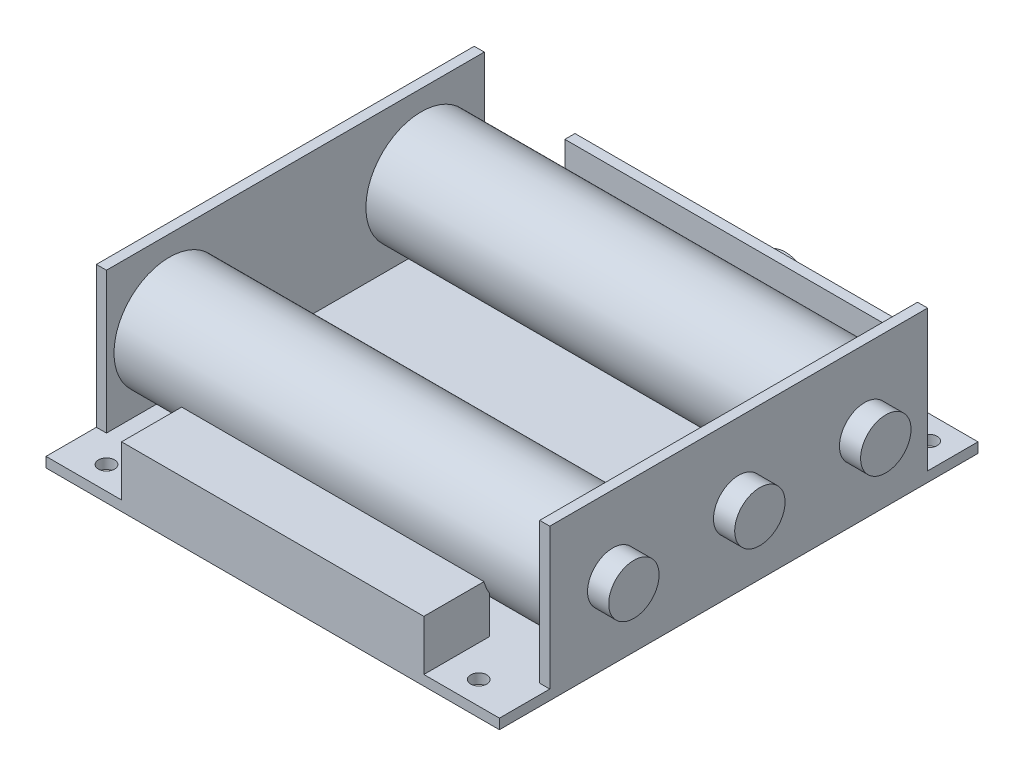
ISO-10303-21;
HEADER;
FILE_DESCRIPTION(('STEP AP214'),'2;1');
FILE_NAME('part.step','',(''),(''),'','','');
FILE_SCHEMA(('AUTOMOTIVE_DESIGN { 1 0 10303 214 1 1 1 1 }'));
ENDSEC;
DATA;
#1=APPLICATION_CONTEXT('core data for automotive mechanical design processes');
#2=APPLICATION_PROTOCOL_DEFINITION('international standard','automotive_design',2000,#1);
#3=PRODUCT_CONTEXT('',#1,'mechanical');
#4=PRODUCT('Part','Part','',(#3));
#5=PRODUCT_RELATED_PRODUCT_CATEGORY('part','',(#4));
#6=PRODUCT_DEFINITION_FORMATION('','',#4);
#7=PRODUCT_DEFINITION_CONTEXT('part definition',#1,'design');
#8=PRODUCT_DEFINITION('design','',#6,#7);
#9=PRODUCT_DEFINITION_SHAPE('','',#8);
#10=(LENGTH_UNIT() NAMED_UNIT(*) SI_UNIT(.MILLI.,.METRE.));
#11=(NAMED_UNIT(*) PLANE_ANGLE_UNIT() SI_UNIT($,.RADIAN.));
#12=(NAMED_UNIT(*) SI_UNIT($,.STERADIAN.) SOLID_ANGLE_UNIT());
#13=UNCERTAINTY_MEASURE_WITH_UNIT(LENGTH_MEASURE(1.E-05),#10,'distance_accuracy_value','');
#14=(GEOMETRIC_REPRESENTATION_CONTEXT(3) GLOBAL_UNCERTAINTY_ASSIGNED_CONTEXT((#13)) GLOBAL_UNIT_ASSIGNED_CONTEXT((#10,
#11,#12)) REPRESENTATION_CONTEXT('',''));
#15=CARTESIAN_POINT('',(0.,0.,0.));
#16=DIRECTION('',(0.,0.,1.));
#17=DIRECTION('',(1.,0.,0.));
#18=AXIS2_PLACEMENT_3D('',#15,#16,#17);
#19=CARTESIAN_POINT('',(-49.2,15.,25.));
#20=DIRECTION('',(1.,0.,0.));
#21=DIRECTION('',(0.,0.,-1.));
#22=AXIS2_PLACEMENT_3D('',#19,#20,#21);
#23=CYLINDRICAL_SURFACE('',#22,11.);
#24=CARTESIAN_POINT('',(43.,15.,25.));
#25=DIRECTION('',(1.,0.,0.));
#26=DIRECTION('',(0.,0.,-1.));
#27=AXIS2_PLACEMENT_3D('',#24,#25,#26);
#28=CIRCLE('',#27,11.);
#29=CARTESIAN_POINT('',(43.,15.,14.));
#30=VERTEX_POINT('',#29);
#31=EDGE_CURVE('E11',#30,#30,#28,.F.);
#32=ORIENTED_EDGE('',*,*,#31,.T.);
#33=EDGE_LOOP('',(#32));
#34=FACE_BOUND('',#33,.T.);
#35=CARTESIAN_POINT('',(-43.,15.,25.));
#36=DIRECTION('',(1.,0.,0.));
#37=DIRECTION('',(0.,0.,-1.));
#38=AXIS2_PLACEMENT_3D('',#35,#36,#37);
#39=CIRCLE('',#38,11.);
#40=CARTESIAN_POINT('',(-43.,15.,14.));
#41=VERTEX_POINT('',#40);
#42=EDGE_CURVE('E45',#41,#41,#39,.T.);
#43=ORIENTED_EDGE('',*,*,#42,.T.);
#44=EDGE_LOOP('',(#43));
#45=FACE_BOUND('',#44,.T.);
#46=ADVANCED_FACE('F44',(#34,#45),#23,.T.);
#47=OPEN_SHELL('',(#46));
#48=SHELL_BASED_SURFACE_MODEL('B2',(#47));
#49=CARTESIAN_POINT('',(-49.2,15.,-25.));
#50=DIRECTION('',(1.,0.,0.));
#51=DIRECTION('',(0.,0.,-1.));
#52=AXIS2_PLACEMENT_3D('',#49,#50,#51);
#53=CYLINDRICAL_SURFACE('',#52,11.);
#54=CARTESIAN_POINT('',(43.,15.,-25.));
#55=DIRECTION('',(1.,0.,0.));
#56=DIRECTION('',(0.,0.,-1.));
#57=AXIS2_PLACEMENT_3D('',#54,#55,#56);
#58=CIRCLE('',#57,11.);
#59=CARTESIAN_POINT('',(43.,15.,-36.));
#60=VERTEX_POINT('',#59);
#61=EDGE_CURVE('E84',#60,#60,#58,.F.);
#62=ORIENTED_EDGE('',*,*,#61,.T.);
#63=EDGE_LOOP('',(#62));
#64=FACE_BOUND('',#63,.T.);
#65=CARTESIAN_POINT('',(-43.,15.,-25.));
#66=DIRECTION('',(1.,0.,0.));
#67=DIRECTION('',(0.,0.,-1.));
#68=AXIS2_PLACEMENT_3D('',#65,#66,#67);
#69=CIRCLE('',#68,11.);
#70=CARTESIAN_POINT('',(-43.,15.,-36.));
#71=VERTEX_POINT('',#70);
#72=EDGE_CURVE('E43',#71,#71,#69,.T.);
#73=ORIENTED_EDGE('',*,*,#72,.T.);
#74=EDGE_LOOP('',(#73));
#75=FACE_BOUND('',#74,.T.);
#76=ADVANCED_FACE('F80',(#64,#75),#53,.T.);
#77=OPEN_SHELL('',(#76));
#78=SHELL_BASED_SURFACE_MODEL('B6',(#77));
#79=CARTESIAN_POINT('',(45.,2.,-47.5));
#80=DIRECTION('',(0.,0.,1.));
#81=DIRECTION('',(1.,0.,0.));
#82=AXIS2_PLACEMENT_3D('',#79,#80,#81);
#83=PLANE('',#82);
#84=DIRECTION('',(-1.,0.,0.));
#85=VECTOR('',#84,1.);
#86=CARTESIAN_POINT('',(45.,2.,-47.5));
#87=LINE('',#86,#85);
#88=CARTESIAN_POINT('',(-35.,2.,-47.5));
#89=VERTEX_POINT('',#88);
#90=CARTESIAN_POINT('',(-45.,2.,-47.5));
#91=VERTEX_POINT('',#90);
#92=EDGE_CURVE('E440',#89,#91,#87,.T.);
#93=ORIENTED_EDGE('',*,*,#92,.F.);
#94=DIRECTION('',(0.,1.,0.));
#95=VECTOR('',#94,1.);
#96=CARTESIAN_POINT('',(-35.,0.,-47.5));
#97=LINE('',#96,#95);
#98=CARTESIAN_POINT('',(-35.,15.,-47.5));
#99=VERTEX_POINT('',#98);
#100=EDGE_CURVE('E271',#89,#99,#97,.T.);
#101=ORIENTED_EDGE('',*,*,#100,.T.);
#102=DIRECTION('',(1.,0.,0.));
#103=VECTOR('',#102,1.);
#104=CARTESIAN_POINT('',(35.,15.,-47.5));
#105=LINE('',#104,#103);
#106=CARTESIAN_POINT('',(35.,15.,-47.5));
#107=VERTEX_POINT('',#106);
#108=EDGE_CURVE('E259',#99,#107,#105,.T.);
#109=ORIENTED_EDGE('',*,*,#108,.T.);
#110=DIRECTION('',(0.,-1.,0.));
#111=VECTOR('',#110,1.);
#112=CARTESIAN_POINT('',(35.,0.,-47.5));
#113=LINE('',#112,#111);
#114=CARTESIAN_POINT('',(35.,2.,-47.5));
#115=VERTEX_POINT('',#114);
#116=EDGE_CURVE('E268',#107,#115,#113,.T.);
#117=ORIENTED_EDGE('',*,*,#116,.T.);
#118=CARTESIAN_POINT('',(45.,2.,-47.5));
#119=VERTEX_POINT('',#118);
#120=EDGE_CURVE('E441',#119,#115,#87,.T.);
#121=ORIENTED_EDGE('',*,*,#120,.F.);
#122=DIRECTION('',(0.,-1.,0.));
#123=VECTOR('',#122,1.);
#124=CARTESIAN_POINT('',(45.,2.,-47.5));
#125=LINE('',#124,#123);
#126=CARTESIAN_POINT('',(45.,0.,-47.5));
#127=VERTEX_POINT('',#126);
#128=EDGE_CURVE('E453',#119,#127,#125,.T.);
#129=ORIENTED_EDGE('',*,*,#128,.T.);
#130=DIRECTION('',(-1.,0.,0.));
#131=VECTOR('',#130,1.);
#132=CARTESIAN_POINT('',(45.,0.,-47.5));
#133=LINE('',#132,#131);
#134=CARTESIAN_POINT('',(-45.,0.,-47.5));
#135=VERTEX_POINT('',#134);
#136=EDGE_CURVE('E449',#127,#135,#133,.T.);
#137=ORIENTED_EDGE('',*,*,#136,.T.);
#138=DIRECTION('',(0.,-1.,0.));
#139=VECTOR('',#138,1.);
#140=CARTESIAN_POINT('',(-45.,2.,-47.5));
#141=LINE('',#140,#139);
#142=EDGE_CURVE('E443',#91,#135,#141,.T.);
#143=ORIENTED_EDGE('',*,*,#142,.F.);
#144=EDGE_LOOP('',(#93,#101,#109,#117,#121,#129,#137,#143));
#145=FACE_BOUND('',#144,.T.);
#146=CARTESIAN_POINT('',(2.54999999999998,6.3,-47.5));
#147=DIRECTION('',(0.,0.,1.));
#148=DIRECTION('',(1.,0.,0.));
#149=AXIS2_PLACEMENT_3D('',#146,#147,#148);
#150=CIRCLE('',#149,5.);
#151=CARTESIAN_POINT('',(7.54999999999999,6.3,-47.5));
#152=VERTEX_POINT('',#151);
#153=EDGE_CURVE('E78',#152,#152,#150,.F.);
#154=ORIENTED_EDGE('',*,*,#153,.F.);
#155=EDGE_LOOP('',(#154));
#156=FACE_BOUND('',#155,.T.);
#157=ADVANCED_FACE('F107',(#145,#156),#83,.F.);
#158=CARTESIAN_POINT('',(-45.,2.,-47.5));
#159=DIRECTION('',(1.,0.,0.));
#160=DIRECTION('',(0.,0.,-1.));
#161=AXIS2_PLACEMENT_3D('',#158,#159,#160);
#162=PLANE('',#161);
#163=DIRECTION('',(0.,0.,1.));
#164=VECTOR('',#163,1.);
#165=CARTESIAN_POINT('',(-45.,0.,-47.5));
#166=LINE('',#165,#164);
#167=CARTESIAN_POINT('',(-45.,0.,47.5));
#168=VERTEX_POINT('',#167);
#169=EDGE_CURVE('E430',#135,#168,#166,.T.);
#170=ORIENTED_EDGE('',*,*,#169,.T.);
#171=DIRECTION('',(0.,-1.,0.));
#172=VECTOR('',#171,1.);
#173=CARTESIAN_POINT('',(-45.,2.,47.5));
#174=LINE('',#173,#172);
#175=CARTESIAN_POINT('',(-45.,2.,47.5));
#176=VERTEX_POINT('',#175);
#177=EDGE_CURVE('E459',#176,#168,#174,.T.);
#178=ORIENTED_EDGE('',*,*,#177,.F.);
#179=DIRECTION('',(0.,0.,1.));
#180=VECTOR('',#179,1.);
#181=CARTESIAN_POINT('',(-45.,2.,-47.5));
#182=LINE('',#181,#180);
#183=CARTESIAN_POINT('',(-45.,2.,37.5));
#184=VERTEX_POINT('',#183);
#185=EDGE_CURVE('E434',#184,#176,#182,.T.);
#186=ORIENTED_EDGE('',*,*,#185,.F.);
#187=DIRECTION('',(0.,-1.,0.));
#188=VECTOR('',#187,1.);
#189=CARTESIAN_POINT('',(-45.,0.,37.5));
#190=LINE('',#189,#188);
#191=CARTESIAN_POINT('',(-45.,30.,37.5));
#192=VERTEX_POINT('',#191);
#193=EDGE_CURVE('E350',#192,#184,#190,.T.);
#194=ORIENTED_EDGE('',*,*,#193,.F.);
#195=DIRECTION('',(0.,0.,1.));
#196=VECTOR('',#195,1.);
#197=CARTESIAN_POINT('',(-45.,30.,37.5));
#198=LINE('',#197,#196);
#199=CARTESIAN_POINT('',(-45.,30.,-37.5));
#200=VERTEX_POINT('',#199);
#201=EDGE_CURVE('E362',#200,#192,#198,.T.);
#202=ORIENTED_EDGE('',*,*,#201,.F.);
#203=DIRECTION('',(0.,1.,0.));
#204=VECTOR('',#203,1.);
#205=CARTESIAN_POINT('',(-45.,0.,-37.5));
#206=LINE('',#205,#204);
#207=CARTESIAN_POINT('',(-45.,2.,-37.5));
#208=VERTEX_POINT('',#207);
#209=EDGE_CURVE('E355',#208,#200,#206,.T.);
#210=ORIENTED_EDGE('',*,*,#209,.F.);
#211=EDGE_CURVE('E431',#91,#208,#182,.T.);
#212=ORIENTED_EDGE('',*,*,#211,.F.);
#213=ORIENTED_EDGE('',*,*,#142,.T.);
#214=EDGE_LOOP('',(#170,#178,#186,#194,#202,#210,#212,#213));
#215=FACE_BOUND('',#214,.T.);
#216=CARTESIAN_POINT('',(-45.,15.,25.));
#217=DIRECTION('',(1.,0.,0.));
#218=DIRECTION('',(0.,0.,-1.));
#219=AXIS2_PLACEMENT_3D('',#216,#217,#218);
#220=CIRCLE('',#219,5.);
#221=CARTESIAN_POINT('',(-45.,15.,20.));
#222=VERTEX_POINT('',#221);
#223=EDGE_CURVE('E347',#222,#222,#220,.T.);
#224=ORIENTED_EDGE('',*,*,#223,.T.);
#225=EDGE_LOOP('',(#224));
#226=FACE_BOUND('',#225,.T.);
#227=CARTESIAN_POINT('',(-45.,15.,-25.));
#228=DIRECTION('',(1.,0.,0.));
#229=DIRECTION('',(0.,0.,-1.));
#230=AXIS2_PLACEMENT_3D('',#227,#228,#229);
#231=CIRCLE('',#230,5.);
#232=CARTESIAN_POINT('',(-45.,15.,-30.));
#233=VERTEX_POINT('',#232);
#234=EDGE_CURVE('E331',#233,#233,#231,.T.);
#235=ORIENTED_EDGE('',*,*,#234,.T.);
#236=EDGE_LOOP('',(#235));
#237=FACE_BOUND('',#236,.T.);
#238=CARTESIAN_POINT('',(-45.,15.,0.));
#239=DIRECTION('',(1.,0.,0.));
#240=DIRECTION('',(0.,0.,-1.));
#241=AXIS2_PLACEMENT_3D('',#238,#239,#240);
#242=CIRCLE('',#241,5.);
#243=CARTESIAN_POINT('',(-45.,15.,-4.99999999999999));
#244=VERTEX_POINT('',#243);
#245=EDGE_CURVE('E115',#244,#244,#242,.F.);
#246=ORIENTED_EDGE('',*,*,#245,.F.);
#247=EDGE_LOOP('',(#246));
#248=FACE_BOUND('',#247,.T.);
#249=ADVANCED_FACE('F109',(#215,#226,#237,#248),#162,.F.);
#250=CARTESIAN_POINT('',(0.,2.,0.));
#251=DIRECTION('',(0.,-1.,0.));
#252=DIRECTION('',(0.,0.,-1.));
#253=AXIS2_PLACEMENT_3D('',#250,#251,#252);
#254=PLANE('',#253);
#255=ORIENTED_EDGE('',*,*,#120,.T.);
#256=DIRECTION('',(0.,0.,1.));
#257=VECTOR('',#256,1.);
#258=CARTESIAN_POINT('',(35.,2.,0.));
#259=LINE('',#258,#257);
#260=CARTESIAN_POINT('',(35.,2.,-45.5));
#261=VERTEX_POINT('',#260);
#262=EDGE_CURVE('E127',#115,#261,#259,.T.);
#263=ORIENTED_EDGE('',*,*,#262,.T.);
#264=DIRECTION('',(-1.,0.,0.));
#265=VECTOR('',#264,1.);
#266=CARTESIAN_POINT('',(0.,2.,-45.5));
#267=LINE('',#266,#265);
#268=CARTESIAN_POINT('',(-35.,2.,-45.5));
#269=VERTEX_POINT('',#268);
#270=EDGE_CURVE('E122',#261,#269,#267,.T.);
#271=ORIENTED_EDGE('',*,*,#270,.T.);
#272=DIRECTION('',(0.,0.,-1.));
#273=VECTOR('',#272,1.);
#274=CARTESIAN_POINT('',(-35.,2.,0.));
#275=LINE('',#274,#273);
#276=EDGE_CURVE('E249',#269,#89,#275,.T.);
#277=ORIENTED_EDGE('',*,*,#276,.T.);
#278=ORIENTED_EDGE('',*,*,#92,.T.);
#279=ORIENTED_EDGE('',*,*,#211,.T.);
#280=DIRECTION('',(-1.,0.,0.));
#281=VECTOR('',#280,1.);
#282=CARTESIAN_POINT('',(0.,2.,-37.5));
#283=LINE('',#282,#281);
#284=CARTESIAN_POINT('',(-43.,2.,-37.5));
#285=VERTEX_POINT('',#284);
#286=EDGE_CURVE('E372',#285,#208,#283,.T.);
#287=ORIENTED_EDGE('',*,*,#286,.F.);
#288=DIRECTION('',(0.,0.,1.));
#289=VECTOR('',#288,1.);
#290=CARTESIAN_POINT('',(-43.,2.,0.));
#291=LINE('',#290,#289);
#292=CARTESIAN_POINT('',(-43.,2.,37.5));
#293=VERTEX_POINT('',#292);
#294=EDGE_CURVE('E368',#285,#293,#291,.T.);
#295=ORIENTED_EDGE('',*,*,#294,.T.);
#296=DIRECTION('',(1.,0.,0.));
#297=VECTOR('',#296,1.);
#298=CARTESIAN_POINT('',(0.,2.,37.5));
#299=LINE('',#298,#297);
#300=EDGE_CURVE('E375',#184,#293,#299,.T.);
#301=ORIENTED_EDGE('',*,*,#300,.F.);
#302=ORIENTED_EDGE('',*,*,#185,.T.);
#303=DIRECTION('',(1.,0.,0.));
#304=VECTOR('',#303,1.);
#305=CARTESIAN_POINT('',(45.,2.,47.5));
#306=LINE('',#305,#304);
#307=CARTESIAN_POINT('',(-30.,2.,47.5));
#308=VERTEX_POINT('',#307);
#309=EDGE_CURVE('E435',#176,#308,#306,.T.);
#310=ORIENTED_EDGE('',*,*,#309,.T.);
#311=DIRECTION('',(0.,0.,1.));
#312=VECTOR('',#311,1.);
#313=CARTESIAN_POINT('',(-30.,2.,34.5));
#314=LINE('',#313,#312);
#315=CARTESIAN_POINT('',(-30.,2.,34.5));
#316=VERTEX_POINT('',#315);
#317=EDGE_CURVE('E288',#316,#308,#314,.T.);
#318=ORIENTED_EDGE('',*,*,#317,.F.);
#319=DIRECTION('',(-1.,0.,0.));
#320=VECTOR('',#319,1.);
#321=CARTESIAN_POINT('',(-30.,2.,34.5));
#322=LINE('',#321,#320);
#323=CARTESIAN_POINT('',(30.,2.,34.5));
#324=VERTEX_POINT('',#323);
#325=EDGE_CURVE('E293',#324,#316,#322,.T.);
#326=ORIENTED_EDGE('',*,*,#325,.F.);
#327=DIRECTION('',(0.,0.,-1.));
#328=VECTOR('',#327,1.);
#329=CARTESIAN_POINT('',(30.,2.,34.5));
#330=LINE('',#329,#328);
#331=CARTESIAN_POINT('',(30.,2.,47.5));
#332=VERTEX_POINT('',#331);
#333=EDGE_CURVE('E302',#332,#324,#330,.T.);
#334=ORIENTED_EDGE('',*,*,#333,.F.);
#335=CARTESIAN_POINT('',(45.,2.,47.5));
#336=VERTEX_POINT('',#335);
#337=EDGE_CURVE('E433',#332,#336,#306,.T.);
#338=ORIENTED_EDGE('',*,*,#337,.T.);
#339=DIRECTION('',(0.,0.,-1.));
#340=VECTOR('',#339,1.);
#341=CARTESIAN_POINT('',(45.,2.,-47.5));
#342=LINE('',#341,#340);
#343=CARTESIAN_POINT('',(45.,2.,37.5));
#344=VERTEX_POINT('',#343);
#345=EDGE_CURVE('E438',#336,#344,#342,.T.);
#346=ORIENTED_EDGE('',*,*,#345,.T.);
#347=DIRECTION('',(-1.,0.,0.));
#348=VECTOR('',#347,1.);
#349=CARTESIAN_POINT('',(0.,2.,37.5));
#350=LINE('',#349,#348);
#351=CARTESIAN_POINT('',(43.,2.,37.5));
#352=VERTEX_POINT('',#351);
#353=EDGE_CURVE('E404',#344,#352,#350,.T.);
#354=ORIENTED_EDGE('',*,*,#353,.T.);
#355=DIRECTION('',(0.,0.,-1.));
#356=VECTOR('',#355,1.);
#357=CARTESIAN_POINT('',(43.,2.,0.));
#358=LINE('',#357,#356);
#359=CARTESIAN_POINT('',(43.,2.,-37.5));
#360=VERTEX_POINT('',#359);
#361=EDGE_CURVE('E397',#352,#360,#358,.T.);
#362=ORIENTED_EDGE('',*,*,#361,.T.);
#363=DIRECTION('',(1.,0.,0.));
#364=VECTOR('',#363,1.);
#365=CARTESIAN_POINT('',(0.,2.,-37.5));
#366=LINE('',#365,#364);
#367=CARTESIAN_POINT('',(45.,2.,-37.5));
#368=VERTEX_POINT('',#367);
#369=EDGE_CURVE('E401',#360,#368,#366,.T.);
#370=ORIENTED_EDGE('',*,*,#369,.T.);
#371=EDGE_CURVE('E437',#368,#119,#342,.T.);
#372=ORIENTED_EDGE('',*,*,#371,.T.);
#373=EDGE_LOOP('',(#255,#263,#271,#277,#278,#279,#287,#295,#301,#302,#310,#318,#326,#334,#338,
#346,#354,#362,#370,#372));
#374=FACE_BOUND('',#373,.T.);
#375=CARTESIAN_POINT('',(-37.6,2.,42.9));
#376=DIRECTION('',(0.,-1.,0.));
#377=DIRECTION('',(0.,0.,-1.));
#378=AXIS2_PLACEMENT_3D('',#375,#376,#377);
#379=CIRCLE('',#378,1.6);
#380=CARTESIAN_POINT('',(-37.6,2.,41.3));
#381=VERTEX_POINT('',#380);
#382=EDGE_CURVE('E409',#381,#381,#379,.T.);
#383=ORIENTED_EDGE('',*,*,#382,.T.);
#384=EDGE_LOOP('',(#383));
#385=FACE_BOUND('',#384,.T.);
#386=CARTESIAN_POINT('',(36.3,2.,42.9));
#387=DIRECTION('',(0.,-1.,0.));
#388=DIRECTION('',(0.,0.,-1.));
#389=AXIS2_PLACEMENT_3D('',#386,#387,#388);
#390=CIRCLE('',#389,1.6);
#391=CARTESIAN_POINT('',(36.3,2.,41.3));
#392=VERTEX_POINT('',#391);
#393=EDGE_CURVE('E415',#392,#392,#390,.T.);
#394=ORIENTED_EDGE('',*,*,#393,.T.);
#395=EDGE_LOOP('',(#394));
#396=FACE_BOUND('',#395,.T.);
#397=CARTESIAN_POINT('',(40.,2.,-42.8));
#398=DIRECTION('',(0.,-1.,0.));
#399=DIRECTION('',(0.,0.,-1.));
#400=AXIS2_PLACEMENT_3D('',#397,#398,#399);
#401=CIRCLE('',#400,1.6);
#402=CARTESIAN_POINT('',(40.,2.,-44.4));
#403=VERTEX_POINT('',#402);
#404=EDGE_CURVE('E421',#403,#403,#401,.T.);
#405=ORIENTED_EDGE('',*,*,#404,.T.);
#406=EDGE_LOOP('',(#405));
#407=FACE_BOUND('',#406,.T.);
#408=CARTESIAN_POINT('',(-40.2,2.,-42.8));
#409=DIRECTION('',(0.,-1.,0.));
#410=DIRECTION('',(0.,0.,-1.));
#411=AXIS2_PLACEMENT_3D('',#408,#409,#410);
#412=CIRCLE('',#411,1.6);
#413=CARTESIAN_POINT('',(-40.2,2.,-44.4));
#414=VERTEX_POINT('',#413);
#415=EDGE_CURVE('E427',#414,#414,#412,.T.);
#416=ORIENTED_EDGE('',*,*,#415,.T.);
#417=EDGE_LOOP('',(#416));
#418=FACE_BOUND('',#417,.T.);
#419=ADVANCED_FACE('F471',(#374,#385,#396,#407,#418),#254,.F.);
#420=CARTESIAN_POINT('',(45.,2.,47.5));
#421=DIRECTION('',(0.,0.,-1.));
#422=DIRECTION('',(-1.,0.,0.));
#423=AXIS2_PLACEMENT_3D('',#420,#421,#422);
#424=PLANE('',#423);
#425=DIRECTION('',(1.,0.,0.));
#426=VECTOR('',#425,1.);
#427=CARTESIAN_POINT('',(45.,0.,47.5));
#428=LINE('',#427,#426);
#429=CARTESIAN_POINT('',(45.,0.,47.5));
#430=VERTEX_POINT('',#429);
#431=EDGE_CURVE('E445',#168,#430,#428,.T.);
#432=ORIENTED_EDGE('',*,*,#431,.T.);
#433=DIRECTION('',(0.,-1.,0.));
#434=VECTOR('',#433,1.);
#435=CARTESIAN_POINT('',(45.,2.,47.5));
#436=LINE('',#435,#434);
#437=EDGE_CURVE('E456',#336,#430,#436,.T.);
#438=ORIENTED_EDGE('',*,*,#437,.F.);
#439=ORIENTED_EDGE('',*,*,#337,.F.);
#440=DIRECTION('',(0.,-1.,0.));
#441=VECTOR('',#440,1.);
#442=CARTESIAN_POINT('',(30.,12.,47.5));
#443=LINE('',#442,#441);
#444=CARTESIAN_POINT('',(30.,12.,47.5));
#445=VERTEX_POINT('',#444);
#446=EDGE_CURVE('E312',#445,#332,#443,.T.);
#447=ORIENTED_EDGE('',*,*,#446,.F.);
#448=DIRECTION('',(1.,0.,0.));
#449=VECTOR('',#448,1.);
#450=CARTESIAN_POINT('',(-30.,12.,47.5));
#451=LINE('',#450,#449);
#452=CARTESIAN_POINT('',(-30.,12.,47.5));
#453=VERTEX_POINT('',#452);
#454=EDGE_CURVE('E292',#453,#445,#451,.T.);
#455=ORIENTED_EDGE('',*,*,#454,.F.);
#456=DIRECTION('',(0.,-1.,0.));
#457=VECTOR('',#456,1.);
#458=CARTESIAN_POINT('',(-30.,12.,47.5));
#459=LINE('',#458,#457);
#460=EDGE_CURVE('E315',#453,#308,#459,.T.);
#461=ORIENTED_EDGE('',*,*,#460,.T.);
#462=ORIENTED_EDGE('',*,*,#309,.F.);
#463=ORIENTED_EDGE('',*,*,#177,.T.);
#464=EDGE_LOOP('',(#432,#438,#439,#447,#455,#461,#462,#463));
#465=FACE_BOUND('',#464,.T.);
#466=ADVANCED_FACE('F477',(#465),#424,.F.);
#467=CARTESIAN_POINT('',(45.,2.,-47.5));
#468=DIRECTION('',(-1.,0.,0.));
#469=DIRECTION('',(0.,0.,1.));
#470=AXIS2_PLACEMENT_3D('',#467,#468,#469);
#471=PLANE('',#470);
#472=CARTESIAN_POINT('',(45.,15.,0.));
#473=DIRECTION('',(-1.,0.,0.));
#474=DIRECTION('',(0.,0.,1.));
#475=AXIS2_PLACEMENT_3D('',#472,#473,#474);
#476=CIRCLE('',#475,5.);
#477=CARTESIAN_POINT('',(45.,15.,5.00000000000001));
#478=VERTEX_POINT('',#477);
#479=EDGE_CURVE('E279',#478,#478,#476,.T.);
#480=ORIENTED_EDGE('',*,*,#479,.T.);
#481=EDGE_LOOP('',(#480));
#482=FACE_BOUND('',#481,.T.);
#483=CARTESIAN_POINT('',(45.,15.,-25.));
#484=DIRECTION('',(-1.,0.,0.));
#485=DIRECTION('',(0.,0.,1.));
#486=AXIS2_PLACEMENT_3D('',#483,#484,#485);
#487=CIRCLE('',#486,5.);
#488=CARTESIAN_POINT('',(45.,15.,-20.));
#489=VERTEX_POINT('',#488);
#490=EDGE_CURVE('E324',#489,#489,#487,.T.);
#491=ORIENTED_EDGE('',*,*,#490,.T.);
#492=EDGE_LOOP('',(#491));
#493=FACE_BOUND('',#492,.T.);
#494=CARTESIAN_POINT('',(45.,15.,25.));
#495=DIRECTION('',(-1.,0.,0.));
#496=DIRECTION('',(0.,0.,1.));
#497=AXIS2_PLACEMENT_3D('',#494,#495,#496);
#498=CIRCLE('',#497,5.);
#499=CARTESIAN_POINT('',(45.,15.,30.));
#500=VERTEX_POINT('',#499);
#501=EDGE_CURVE('E340',#500,#500,#498,.T.);
#502=ORIENTED_EDGE('',*,*,#501,.T.);
#503=EDGE_LOOP('',(#502));
#504=FACE_BOUND('',#503,.T.);
#505=ORIENTED_EDGE('',*,*,#371,.F.);
#506=DIRECTION('',(0.,1.,0.));
#507=VECTOR('',#506,1.);
#508=CARTESIAN_POINT('',(45.,0.,-37.5));
#509=LINE('',#508,#507);
#510=CARTESIAN_POINT('',(45.,30.,-37.5));
#511=VERTEX_POINT('',#510);
#512=EDGE_CURVE('E391',#368,#511,#509,.T.);
#513=ORIENTED_EDGE('',*,*,#512,.T.);
#514=DIRECTION('',(0.,0.,1.));
#515=VECTOR('',#514,1.);
#516=CARTESIAN_POINT('',(45.,30.,37.5));
#517=LINE('',#516,#515);
#518=CARTESIAN_POINT('',(45.,30.,37.5));
#519=VERTEX_POINT('',#518);
#520=EDGE_CURVE('E383',#511,#519,#517,.T.);
#521=ORIENTED_EDGE('',*,*,#520,.T.);
#522=DIRECTION('',(0.,-1.,0.));
#523=VECTOR('',#522,1.);
#524=CARTESIAN_POINT('',(45.,0.,37.5));
#525=LINE('',#524,#523);
#526=EDGE_CURVE('E378',#519,#344,#525,.T.);
#527=ORIENTED_EDGE('',*,*,#526,.T.);
#528=ORIENTED_EDGE('',*,*,#345,.F.);
#529=ORIENTED_EDGE('',*,*,#437,.T.);
#530=DIRECTION('',(0.,0.,-1.));
#531=VECTOR('',#530,1.);
#532=CARTESIAN_POINT('',(45.,0.,-47.5));
#533=LINE('',#532,#531);
#534=EDGE_CURVE('E447',#430,#127,#533,.T.);
#535=ORIENTED_EDGE('',*,*,#534,.T.);
#536=ORIENTED_EDGE('',*,*,#128,.F.);
#537=EDGE_LOOP('',(#505,#513,#521,#527,#528,#529,#535,#536));
#538=FACE_BOUND('',#537,.T.);
#539=ADVANCED_FACE('F565',(#482,#493,#504,#538),#471,.F.);
#540=CARTESIAN_POINT('',(0.,0.,0.));
#541=DIRECTION('',(0.,-1.,0.));
#542=DIRECTION('',(0.,0.,-1.));
#543=AXIS2_PLACEMENT_3D('',#540,#541,#542);
#544=PLANE('',#543);
#545=ORIENTED_EDGE('',*,*,#169,.F.);
#546=ORIENTED_EDGE('',*,*,#136,.F.);
#547=ORIENTED_EDGE('',*,*,#534,.F.);
#548=ORIENTED_EDGE('',*,*,#431,.F.);
#549=EDGE_LOOP('',(#545,#546,#547,#548));
#550=FACE_BOUND('',#549,.T.);
#551=CARTESIAN_POINT('',(-40.2,0.,-42.8));
#552=DIRECTION('',(0.,-1.,0.));
#553=DIRECTION('',(0.,0.,-1.));
#554=AXIS2_PLACEMENT_3D('',#551,#552,#553);
#555=CIRCLE('',#554,1.59999999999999);
#556=CARTESIAN_POINT('',(-40.2,0.,-44.4));
#557=VERTEX_POINT('',#556);
#558=EDGE_CURVE('E424',#557,#557,#555,.T.);
#559=ORIENTED_EDGE('',*,*,#558,.F.);
#560=EDGE_LOOP('',(#559));
#561=FACE_BOUND('',#560,.T.);
#562=CARTESIAN_POINT('',(40.,0.,-42.8));
#563=DIRECTION('',(0.,-1.,0.));
#564=DIRECTION('',(0.,0.,-1.));
#565=AXIS2_PLACEMENT_3D('',#562,#563,#564);
#566=CIRCLE('',#565,1.59999999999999);
#567=CARTESIAN_POINT('',(40.,0.,-44.4));
#568=VERTEX_POINT('',#567);
#569=EDGE_CURVE('E418',#568,#568,#566,.T.);
#570=ORIENTED_EDGE('',*,*,#569,.F.);
#571=EDGE_LOOP('',(#570));
#572=FACE_BOUND('',#571,.T.);
#573=CARTESIAN_POINT('',(36.3,0.,42.9));
#574=DIRECTION('',(0.,-1.,0.));
#575=DIRECTION('',(0.,0.,-1.));
#576=AXIS2_PLACEMENT_3D('',#573,#574,#575);
#577=CIRCLE('',#576,1.59999999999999);
#578=CARTESIAN_POINT('',(36.3,0.,41.3));
#579=VERTEX_POINT('',#578);
#580=EDGE_CURVE('E412',#579,#579,#577,.T.);
#581=ORIENTED_EDGE('',*,*,#580,.F.);
#582=EDGE_LOOP('',(#581));
#583=FACE_BOUND('',#582,.T.);
#584=CARTESIAN_POINT('',(-37.6,0.,42.9));
#585=DIRECTION('',(0.,-1.,0.));
#586=DIRECTION('',(0.,0.,-1.));
#587=AXIS2_PLACEMENT_3D('',#584,#585,#586);
#588=CIRCLE('',#587,1.59999999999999);
#589=CARTESIAN_POINT('',(-37.6,0.,41.3));
#590=VERTEX_POINT('',#589);
#591=EDGE_CURVE('E406',#590,#590,#588,.T.);
#592=ORIENTED_EDGE('',*,*,#591,.F.);
#593=EDGE_LOOP('',(#592));
#594=FACE_BOUND('',#593,.T.);
#595=ADVANCED_FACE('F611',(#550,#561,#572,#583,#594),#544,.T.);
#596=CARTESIAN_POINT('',(-40.2,0.,-42.8));
#597=DIRECTION('',(0.,-1.,0.));
#598=DIRECTION('',(0.,0.,-1.));
#599=AXIS2_PLACEMENT_3D('',#596,#597,#598);
#600=CYLINDRICAL_SURFACE('',#599,1.59999999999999);
#601=ORIENTED_EDGE('',*,*,#415,.F.);
#602=EDGE_LOOP('',(#601));
#603=FACE_BOUND('',#602,.T.);
#604=ORIENTED_EDGE('',*,*,#558,.T.);
#605=EDGE_LOOP('',(#604));
#606=FACE_BOUND('',#605,.T.);
#607=ADVANCED_FACE('F608',(#603,#606),#600,.F.);
#608=CARTESIAN_POINT('',(40.,0.,-42.8));
#609=DIRECTION('',(0.,-1.,0.));
#610=DIRECTION('',(0.,0.,-1.));
#611=AXIS2_PLACEMENT_3D('',#608,#609,#610);
#612=CYLINDRICAL_SURFACE('',#611,1.59999999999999);
#613=ORIENTED_EDGE('',*,*,#404,.F.);
#614=EDGE_LOOP('',(#613));
#615=FACE_BOUND('',#614,.T.);
#616=ORIENTED_EDGE('',*,*,#569,.T.);
#617=EDGE_LOOP('',(#616));
#618=FACE_BOUND('',#617,.T.);
#619=ADVANCED_FACE('F604',(#615,#618),#612,.F.);
#620=CARTESIAN_POINT('',(36.3,0.,42.9));
#621=DIRECTION('',(0.,-1.,0.));
#622=DIRECTION('',(0.,0.,-1.));
#623=AXIS2_PLACEMENT_3D('',#620,#621,#622);
#624=CYLINDRICAL_SURFACE('',#623,1.59999999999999);
#625=ORIENTED_EDGE('',*,*,#393,.F.);
#626=EDGE_LOOP('',(#625));
#627=FACE_BOUND('',#626,.T.);
#628=ORIENTED_EDGE('',*,*,#580,.T.);
#629=EDGE_LOOP('',(#628));
#630=FACE_BOUND('',#629,.T.);
#631=ADVANCED_FACE('F600',(#627,#630),#624,.F.);
#632=CARTESIAN_POINT('',(-37.6,0.,42.9));
#633=DIRECTION('',(0.,-1.,0.));
#634=DIRECTION('',(0.,0.,-1.));
#635=AXIS2_PLACEMENT_3D('',#632,#633,#634);
#636=CYLINDRICAL_SURFACE('',#635,1.59999999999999);
#637=ORIENTED_EDGE('',*,*,#382,.F.);
#638=EDGE_LOOP('',(#637));
#639=FACE_BOUND('',#638,.T.);
#640=ORIENTED_EDGE('',*,*,#591,.T.);
#641=EDGE_LOOP('',(#640));
#642=FACE_BOUND('',#641,.T.);
#643=ADVANCED_FACE('F597',(#639,#642),#636,.F.);
#644=CARTESIAN_POINT('',(43.,0.,37.5));
#645=DIRECTION('',(0.,0.,1.));
#646=DIRECTION('',(1.,0.,0.));
#647=AXIS2_PLACEMENT_3D('',#644,#645,#646);
#648=PLANE('',#647);
#649=ORIENTED_EDGE('',*,*,#353,.F.);
#650=ORIENTED_EDGE('',*,*,#526,.F.);
#651=DIRECTION('',(1.,0.,0.));
#652=VECTOR('',#651,1.);
#653=CARTESIAN_POINT('',(43.,30.,37.5));
#654=LINE('',#653,#652);
#655=CARTESIAN_POINT('',(43.,30.,37.5));
#656=VERTEX_POINT('',#655);
#657=EDGE_CURVE('E395',#656,#519,#654,.T.);
#658=ORIENTED_EDGE('',*,*,#657,.F.);
#659=DIRECTION('',(0.,-1.,0.));
#660=VECTOR('',#659,1.);
#661=CARTESIAN_POINT('',(43.,0.,37.5));
#662=LINE('',#661,#660);
#663=EDGE_CURVE('E379',#656,#352,#662,.T.);
#664=ORIENTED_EDGE('',*,*,#663,.T.);
#665=EDGE_LOOP('',(#649,#650,#658,#664));
#666=FACE_BOUND('',#665,.T.);
#667=ADVANCED_FACE('F569',(#666),#648,.T.);
#668=CARTESIAN_POINT('',(43.,0.,-37.5));
#669=DIRECTION('',(0.,0.,-1.));
#670=DIRECTION('',(-1.,0.,0.));
#671=AXIS2_PLACEMENT_3D('',#668,#669,#670);
#672=PLANE('',#671);
#673=ORIENTED_EDGE('',*,*,#369,.F.);
#674=DIRECTION('',(0.,1.,0.));
#675=VECTOR('',#674,1.);
#676=CARTESIAN_POINT('',(43.,0.,-37.5));
#677=LINE('',#676,#675);
#678=CARTESIAN_POINT('',(43.,30.,-37.5));
#679=VERTEX_POINT('',#678);
#680=EDGE_CURVE('E382',#360,#679,#677,.T.);
#681=ORIENTED_EDGE('',*,*,#680,.T.);
#682=DIRECTION('',(1.,0.,0.));
#683=VECTOR('',#682,1.);
#684=CARTESIAN_POINT('',(43.,30.,-37.5));
#685=LINE('',#684,#683);
#686=EDGE_CURVE('E388',#679,#511,#685,.T.);
#687=ORIENTED_EDGE('',*,*,#686,.T.);
#688=ORIENTED_EDGE('',*,*,#512,.F.);
#689=EDGE_LOOP('',(#673,#681,#687,#688));
#690=FACE_BOUND('',#689,.T.);
#691=ADVANCED_FACE('F579',(#690),#672,.T.);
#692=CARTESIAN_POINT('',(43.,0.,0.));
#693=DIRECTION('',(-1.,0.,0.));
#694=DIRECTION('',(0.,0.,1.));
#695=AXIS2_PLACEMENT_3D('',#692,#693,#694);
#696=PLANE('',#695);
#697=CARTESIAN_POINT('',(43.,15.,-25.));
#698=DIRECTION('',(-1.,0.,0.));
#699=DIRECTION('',(0.,0.,1.));
#700=AXIS2_PLACEMENT_3D('',#697,#698,#699);
#701=CIRCLE('',#700,5.);
#702=CARTESIAN_POINT('',(43.,15.,-20.));
#703=VERTEX_POINT('',#702);
#704=EDGE_CURVE('E325',#703,#703,#701,.T.);
#705=ORIENTED_EDGE('',*,*,#704,.F.);
#706=EDGE_LOOP('',(#705));
#707=FACE_BOUND('',#706,.T.);
#708=CARTESIAN_POINT('',(43.,15.,25.));
#709=DIRECTION('',(-1.,0.,0.));
#710=DIRECTION('',(0.,0.,1.));
#711=AXIS2_PLACEMENT_3D('',#708,#709,#710);
#712=CIRCLE('',#711,5.);
#713=CARTESIAN_POINT('',(43.,15.,30.));
#714=VERTEX_POINT('',#713);
#715=EDGE_CURVE('E341',#714,#714,#712,.T.);
#716=ORIENTED_EDGE('',*,*,#715,.F.);
#717=EDGE_LOOP('',(#716));
#718=FACE_BOUND('',#717,.T.);
#719=ORIENTED_EDGE('',*,*,#361,.F.);
#720=ORIENTED_EDGE('',*,*,#663,.F.);
#721=DIRECTION('',(0.,0.,1.));
#722=VECTOR('',#721,1.);
#723=CARTESIAN_POINT('',(43.,30.,37.5));
#724=LINE('',#723,#722);
#725=EDGE_CURVE('E385',#679,#656,#724,.T.);
#726=ORIENTED_EDGE('',*,*,#725,.F.);
#727=ORIENTED_EDGE('',*,*,#680,.F.);
#728=EDGE_LOOP('',(#719,#720,#726,#727));
#729=FACE_BOUND('',#728,.T.);
#730=ADVANCED_FACE('F575',(#707,#718,#729),#696,.T.);
#731=CARTESIAN_POINT('',(43.,30.,37.5));
#732=DIRECTION('',(0.,1.,0.));
#733=DIRECTION('',(0.,0.,1.));
#734=AXIS2_PLACEMENT_3D('',#731,#732,#733);
#735=PLANE('',#734);
#736=ORIENTED_EDGE('',*,*,#520,.F.);
#737=ORIENTED_EDGE('',*,*,#686,.F.);
#738=ORIENTED_EDGE('',*,*,#725,.T.);
#739=ORIENTED_EDGE('',*,*,#657,.T.);
#740=EDGE_LOOP('',(#736,#737,#738,#739));
#741=FACE_BOUND('',#740,.T.);
#742=ADVANCED_FACE('F582',(#741),#735,.T.);
#743=CARTESIAN_POINT('',(-43.,0.,37.5));
#744=DIRECTION('',(0.,0.,-1.));
#745=DIRECTION('',(-1.,0.,0.));
#746=AXIS2_PLACEMENT_3D('',#743,#744,#745);
#747=PLANE('',#746);
#748=ORIENTED_EDGE('',*,*,#193,.T.);
#749=ORIENTED_EDGE('',*,*,#300,.T.);
#750=DIRECTION('',(0.,-1.,0.));
#751=VECTOR('',#750,1.);
#752=CARTESIAN_POINT('',(-43.,0.,37.5));
#753=LINE('',#752,#751);
#754=CARTESIAN_POINT('',(-43.,30.,37.5));
#755=VERTEX_POINT('',#754);
#756=EDGE_CURVE('E351',#755,#293,#753,.T.);
#757=ORIENTED_EDGE('',*,*,#756,.F.);
#758=DIRECTION('',(-1.,0.,0.));
#759=VECTOR('',#758,1.);
#760=CARTESIAN_POINT('',(-43.,30.,37.5));
#761=LINE('',#760,#759);
#762=EDGE_CURVE('E359',#755,#192,#761,.T.);
#763=ORIENTED_EDGE('',*,*,#762,.T.);
#764=EDGE_LOOP('',(#748,#749,#757,#763));
#765=FACE_BOUND('',#764,.T.);
#766=ADVANCED_FACE('F543',(#765),#747,.F.);
#767=CARTESIAN_POINT('',(-43.,0.,-37.5));
#768=DIRECTION('',(0.,0.,1.));
#769=DIRECTION('',(1.,0.,0.));
#770=AXIS2_PLACEMENT_3D('',#767,#768,#769);
#771=PLANE('',#770);
#772=DIRECTION('',(0.,1.,0.));
#773=VECTOR('',#772,1.);
#774=CARTESIAN_POINT('',(-43.,0.,-37.5));
#775=LINE('',#774,#773);
#776=CARTESIAN_POINT('',(-43.,30.,-37.5));
#777=VERTEX_POINT('',#776);
#778=EDGE_CURVE('E357',#285,#777,#775,.T.);
#779=ORIENTED_EDGE('',*,*,#778,.F.);
#780=ORIENTED_EDGE('',*,*,#286,.T.);
#781=ORIENTED_EDGE('',*,*,#209,.T.);
#782=DIRECTION('',(-1.,0.,0.));
#783=VECTOR('',#782,1.);
#784=CARTESIAN_POINT('',(-43.,30.,-37.5));
#785=LINE('',#784,#783);
#786=EDGE_CURVE('E365',#777,#200,#785,.T.);
#787=ORIENTED_EDGE('',*,*,#786,.F.);
#788=EDGE_LOOP('',(#779,#780,#781,#787));
#789=FACE_BOUND('',#788,.T.);
#790=ADVANCED_FACE('F526',(#789),#771,.F.);
#791=CARTESIAN_POINT('',(-43.,0.,0.));
#792=DIRECTION('',(1.,0.,0.));
#793=DIRECTION('',(0.,0.,1.));
#794=AXIS2_PLACEMENT_3D('',#791,#792,#793);
#795=PLANE('',#794);
#796=CARTESIAN_POINT('',(-43.,15.,-25.));
#797=DIRECTION('',(1.,0.,0.));
#798=DIRECTION('',(0.,0.,-1.));
#799=AXIS2_PLACEMENT_3D('',#796,#797,#798);
#800=CIRCLE('',#799,5.);
#801=CARTESIAN_POINT('',(-43.,15.,-30.));
#802=VERTEX_POINT('',#801);
#803=EDGE_CURVE('E328',#802,#802,#800,.T.);
#804=ORIENTED_EDGE('',*,*,#803,.F.);
#805=EDGE_LOOP('',(#804));
#806=FACE_BOUND('',#805,.T.);
#807=CARTESIAN_POINT('',(-43.,15.,25.));
#808=DIRECTION('',(1.,0.,0.));
#809=DIRECTION('',(0.,0.,-1.));
#810=AXIS2_PLACEMENT_3D('',#807,#808,#809);
#811=CIRCLE('',#810,5.);
#812=CARTESIAN_POINT('',(-43.,15.,20.));
#813=VERTEX_POINT('',#812);
#814=EDGE_CURVE('E344',#813,#813,#811,.T.);
#815=ORIENTED_EDGE('',*,*,#814,.F.);
#816=EDGE_LOOP('',(#815));
#817=FACE_BOUND('',#816,.T.);
#818=ORIENTED_EDGE('',*,*,#294,.F.);
#819=ORIENTED_EDGE('',*,*,#778,.T.);
#820=DIRECTION('',(0.,0.,1.));
#821=VECTOR('',#820,1.);
#822=CARTESIAN_POINT('',(-43.,30.,37.5));
#823=LINE('',#822,#821);
#824=EDGE_CURVE('E354',#777,#755,#823,.T.);
#825=ORIENTED_EDGE('',*,*,#824,.T.);
#826=ORIENTED_EDGE('',*,*,#756,.T.);
#827=EDGE_LOOP('',(#818,#819,#825,#826));
#828=FACE_BOUND('',#827,.T.);
#829=ADVANCED_FACE('F522',(#806,#817,#828),#795,.T.);
#830=CARTESIAN_POINT('',(-43.,30.,37.5));
#831=DIRECTION('',(0.,-1.,0.));
#832=DIRECTION('',(0.,0.,-1.));
#833=AXIS2_PLACEMENT_3D('',#830,#831,#832);
#834=PLANE('',#833);
#835=ORIENTED_EDGE('',*,*,#201,.T.);
#836=ORIENTED_EDGE('',*,*,#762,.F.);
#837=ORIENTED_EDGE('',*,*,#824,.F.);
#838=ORIENTED_EDGE('',*,*,#786,.T.);
#839=EDGE_LOOP('',(#835,#836,#837,#838));
#840=FACE_BOUND('',#839,.T.);
#841=ADVANCED_FACE('F525',(#840),#834,.F.);
#842=CARTESIAN_POINT('',(-49.2,15.,25.));
#843=DIRECTION('',(1.,0.,0.));
#844=DIRECTION('',(0.,0.,-1.));
#845=AXIS2_PLACEMENT_3D('',#842,#843,#844);
#846=CYLINDRICAL_SURFACE('',#845,5.);
#847=ORIENTED_EDGE('',*,*,#715,.T.);
#848=EDGE_LOOP('',(#847));
#849=FACE_BOUND('',#848,.T.);
#850=ORIENTED_EDGE('',*,*,#814,.T.);
#851=EDGE_LOOP('',(#850));
#852=FACE_BOUND('',#851,.T.);
#853=ADVANCED_FACE('F684',(#849,#852),#846,.T.);
#854=CARTESIAN_POINT('',(49.2,15.,25.));
#855=DIRECTION('',(1.,0.,0.));
#856=DIRECTION('',(0.,0.,-1.));
#857=AXIS2_PLACEMENT_3D('',#854,#855,#856);
#858=PLANE('',#857);
#859=CARTESIAN_POINT('',(49.2,15.,25.));
#860=DIRECTION('',(1.,0.,0.));
#861=DIRECTION('',(0.,0.,-1.));
#862=AXIS2_PLACEMENT_3D('',#859,#860,#861);
#863=CIRCLE('',#862,5.);
#864=CARTESIAN_POINT('',(49.2,15.,20.));
#865=VERTEX_POINT('',#864);
#866=EDGE_CURVE('E334',#865,#865,#863,.T.);
#867=ORIENTED_EDGE('',*,*,#866,.T.);
#868=EDGE_LOOP('',(#867));
#869=FACE_BOUND('',#868,.T.);
#870=ADVANCED_FACE('F689',(#869),#858,.T.);
#871=ORIENTED_EDGE('',*,*,#866,.F.);
#872=EDGE_LOOP('',(#871));
#873=FACE_BOUND('',#872,.T.);
#874=ORIENTED_EDGE('',*,*,#501,.F.);
#875=EDGE_LOOP('',(#874));
#876=FACE_BOUND('',#875,.T.);
#877=ADVANCED_FACE('F692',(#873,#876),#846,.T.);
#878=CARTESIAN_POINT('',(-49.2,15.,25.));
#879=DIRECTION('',(1.,0.,0.));
#880=DIRECTION('',(0.,0.,-1.));
#881=AXIS2_PLACEMENT_3D('',#878,#879,#880);
#882=CIRCLE('',#881,5.);
#883=CARTESIAN_POINT('',(-49.2,15.,20.));
#884=VERTEX_POINT('',#883);
#885=EDGE_CURVE('E337',#884,#884,#882,.T.);
#886=ORIENTED_EDGE('',*,*,#885,.T.);
#887=EDGE_LOOP('',(#886));
#888=FACE_BOUND('',#887,.T.);
#889=ORIENTED_EDGE('',*,*,#223,.F.);
#890=EDGE_LOOP('',(#889));
#891=FACE_BOUND('',#890,.T.);
#892=ADVANCED_FACE('F515',(#888,#891),#846,.T.);
#893=CARTESIAN_POINT('',(-49.2,15.,25.));
#894=DIRECTION('',(1.,0.,0.));
#895=DIRECTION('',(0.,0.,-1.));
#896=AXIS2_PLACEMENT_3D('',#893,#894,#895);
#897=PLANE('',#896);
#898=ORIENTED_EDGE('',*,*,#885,.F.);
#899=EDGE_LOOP('',(#898));
#900=FACE_BOUND('',#899,.T.);
#901=ADVANCED_FACE('F507',(#900),#897,.F.);
#902=CARTESIAN_POINT('',(-49.2,15.,-25.));
#903=DIRECTION('',(1.,0.,0.));
#904=DIRECTION('',(0.,0.,-1.));
#905=AXIS2_PLACEMENT_3D('',#902,#903,#904);
#906=CYLINDRICAL_SURFACE('',#905,5.);
#907=ORIENTED_EDGE('',*,*,#704,.T.);
#908=EDGE_LOOP('',(#907));
#909=FACE_BOUND('',#908,.T.);
#910=ORIENTED_EDGE('',*,*,#803,.T.);
#911=EDGE_LOOP('',(#910));
#912=FACE_BOUND('',#911,.T.);
#913=ADVANCED_FACE('F495',(#909,#912),#906,.T.);
#914=CARTESIAN_POINT('',(49.2,15.,-25.));
#915=DIRECTION('',(1.,0.,0.));
#916=DIRECTION('',(0.,0.,-1.));
#917=AXIS2_PLACEMENT_3D('',#914,#915,#916);
#918=PLANE('',#917);
#919=CARTESIAN_POINT('',(49.2,15.,-25.));
#920=DIRECTION('',(1.,0.,0.));
#921=DIRECTION('',(0.,0.,-1.));
#922=AXIS2_PLACEMENT_3D('',#919,#920,#921);
#923=CIRCLE('',#922,5.);
#924=CARTESIAN_POINT('',(49.2,15.,-30.));
#925=VERTEX_POINT('',#924);
#926=EDGE_CURVE('E318',#925,#925,#923,.T.);
#927=ORIENTED_EDGE('',*,*,#926,.T.);
#928=EDGE_LOOP('',(#927));
#929=FACE_BOUND('',#928,.T.);
#930=ADVANCED_FACE('F503',(#929),#918,.T.);
#931=ORIENTED_EDGE('',*,*,#926,.F.);
#932=EDGE_LOOP('',(#931));
#933=FACE_BOUND('',#932,.T.);
#934=ORIENTED_EDGE('',*,*,#490,.F.);
#935=EDGE_LOOP('',(#934));
#936=FACE_BOUND('',#935,.T.);
#937=ADVANCED_FACE('F492',(#933,#936),#906,.T.);
#938=CARTESIAN_POINT('',(-49.2,15.,-25.));
#939=DIRECTION('',(1.,0.,0.));
#940=DIRECTION('',(0.,0.,-1.));
#941=AXIS2_PLACEMENT_3D('',#938,#939,#940);
#942=CIRCLE('',#941,5.);
#943=CARTESIAN_POINT('',(-49.2,15.,-30.));
#944=VERTEX_POINT('',#943);
#945=EDGE_CURVE('E321',#944,#944,#942,.T.);
#946=ORIENTED_EDGE('',*,*,#945,.T.);
#947=EDGE_LOOP('',(#946));
#948=FACE_BOUND('',#947,.T.);
#949=ORIENTED_EDGE('',*,*,#234,.F.);
#950=EDGE_LOOP('',(#949));
#951=FACE_BOUND('',#950,.T.);
#952=ADVANCED_FACE('F489',(#948,#951),#906,.T.);
#953=CARTESIAN_POINT('',(-49.2,15.,-25.));
#954=DIRECTION('',(1.,0.,0.));
#955=DIRECTION('',(0.,0.,-1.));
#956=AXIS2_PLACEMENT_3D('',#953,#954,#955);
#957=PLANE('',#956);
#958=ORIENTED_EDGE('',*,*,#945,.F.);
#959=EDGE_LOOP('',(#958));
#960=FACE_BOUND('',#959,.T.);
#961=ADVANCED_FACE('F491',(#960),#957,.F.);
#962=CARTESIAN_POINT('',(-30.,12.,34.5));
#963=DIRECTION('',(1.,0.,0.));
#964=DIRECTION('',(0.,0.,-1.));
#965=AXIS2_PLACEMENT_3D('',#962,#963,#964);
#966=PLANE('',#965);
#967=ORIENTED_EDGE('',*,*,#317,.T.);
#968=ORIENTED_EDGE('',*,*,#460,.F.);
#969=DIRECTION('',(0.,0.,1.));
#970=VECTOR('',#969,1.);
#971=CARTESIAN_POINT('',(-30.,12.,34.5));
#972=LINE('',#971,#970);
#973=CARTESIAN_POINT('',(-30.,12.,34.5));
#974=VERTEX_POINT('',#973);
#975=EDGE_CURVE('E289',#974,#453,#972,.T.);
#976=ORIENTED_EDGE('',*,*,#975,.F.);
#977=DIRECTION('',(0.,-1.,0.));
#978=VECTOR('',#977,1.);
#979=CARTESIAN_POINT('',(-30.,12.,34.5));
#980=LINE('',#979,#978);
#981=EDGE_CURVE('E299',#974,#316,#980,.T.);
#982=ORIENTED_EDGE('',*,*,#981,.T.);
#983=EDGE_LOOP('',(#967,#968,#976,#982));
#984=FACE_BOUND('',#983,.T.);
#985=ADVANCED_FACE('F500',(#984),#966,.F.);
#986=CARTESIAN_POINT('',(30.,12.,34.5));
#987=DIRECTION('',(-1.,0.,0.));
#988=DIRECTION('',(0.,0.,1.));
#989=AXIS2_PLACEMENT_3D('',#986,#987,#988);
#990=PLANE('',#989);
#991=ORIENTED_EDGE('',*,*,#333,.T.);
#992=DIRECTION('',(0.,-1.,0.));
#993=VECTOR('',#992,1.);
#994=CARTESIAN_POINT('',(30.,12.,34.5));
#995=LINE('',#994,#993);
#996=CARTESIAN_POINT('',(30.,12.,34.5));
#997=VERTEX_POINT('',#996);
#998=EDGE_CURVE('E309',#997,#324,#995,.T.);
#999=ORIENTED_EDGE('',*,*,#998,.F.);
#1000=DIRECTION('',(0.,0.,-1.));
#1001=VECTOR('',#1000,1.);
#1002=CARTESIAN_POINT('',(30.,12.,34.5));
#1003=LINE('',#1002,#1001);
#1004=EDGE_CURVE('E295',#445,#997,#1003,.T.);
#1005=ORIENTED_EDGE('',*,*,#1004,.F.);
#1006=ORIENTED_EDGE('',*,*,#446,.T.);
#1007=EDGE_LOOP('',(#991,#999,#1005,#1006));
#1008=FACE_BOUND('',#1007,.T.);
#1009=ADVANCED_FACE('F559',(#1008),#990,.F.);
#1010=CARTESIAN_POINT('',(-30.,12.,34.5));
#1011=DIRECTION('',(0.,0.,1.));
#1012=DIRECTION('',(1.,0.,0.));
#1013=AXIS2_PLACEMENT_3D('',#1010,#1011,#1012);
#1014=PLANE('',#1013);
#1015=ORIENTED_EDGE('',*,*,#325,.T.);
#1016=ORIENTED_EDGE('',*,*,#981,.F.);
#1017=DIRECTION('',(-1.,0.,0.));
#1018=VECTOR('',#1017,1.);
#1019=CARTESIAN_POINT('',(-30.,12.,34.5));
#1020=LINE('',#1019,#1018);
#1021=EDGE_CURVE('E297',#997,#974,#1020,.T.);
#1022=ORIENTED_EDGE('',*,*,#1021,.F.);
#1023=ORIENTED_EDGE('',*,*,#998,.T.);
#1024=EDGE_LOOP('',(#1015,#1016,#1022,#1023));
#1025=FACE_BOUND('',#1024,.T.);
#1026=ADVANCED_FACE('F554',(#1025),#1014,.F.);
#1027=CARTESIAN_POINT('',(0.,12.,0.));
#1028=DIRECTION('',(0.,1.,0.));
#1029=DIRECTION('',(0.,0.,1.));
#1030=AXIS2_PLACEMENT_3D('',#1027,#1028,#1029);
#1031=PLANE('',#1030);
#1032=ORIENTED_EDGE('',*,*,#975,.T.);
#1033=ORIENTED_EDGE('',*,*,#454,.T.);
#1034=ORIENTED_EDGE('',*,*,#1004,.T.);
#1035=ORIENTED_EDGE('',*,*,#1021,.T.);
#1036=EDGE_LOOP('',(#1032,#1033,#1034,#1035));
#1037=FACE_BOUND('',#1036,.T.);
#1038=ADVANCED_FACE('F766',(#1037),#1031,.T.);
#1039=CARTESIAN_POINT('',(-49.2,15.,0.));
#1040=DIRECTION('',(1.,0.,0.));
#1041=DIRECTION('',(0.,0.,-1.));
#1042=AXIS2_PLACEMENT_3D('',#1039,#1040,#1041);
#1043=CYLINDRICAL_SURFACE('',#1042,5.);
#1044=CARTESIAN_POINT('',(-49.2,15.,0.));
#1045=DIRECTION('',(-1.,0.,0.));
#1046=DIRECTION('',(0.,0.,1.));
#1047=AXIS2_PLACEMENT_3D('',#1044,#1045,#1046);
#1048=CIRCLE('',#1047,5.);
#1049=CARTESIAN_POINT('',(-49.2,15.,5.00000000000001));
#1050=VERTEX_POINT('',#1049);
#1051=EDGE_CURVE('E283',#1050,#1050,#1048,.T.);
#1052=ORIENTED_EDGE('',*,*,#1051,.F.);
#1053=EDGE_LOOP('',(#1052));
#1054=FACE_BOUND('',#1053,.T.);
#1055=ORIENTED_EDGE('',*,*,#245,.T.);
#1056=EDGE_LOOP('',(#1055));
#1057=FACE_BOUND('',#1056,.T.);
#1058=ADVANCED_FACE('F468',(#1054,#1057),#1043,.T.);
#1059=CARTESIAN_POINT('',(-49.2,15.,0.));
#1060=DIRECTION('',(-1.,0.,0.));
#1061=DIRECTION('',(0.,0.,1.));
#1062=AXIS2_PLACEMENT_3D('',#1059,#1060,#1061);
#1063=PLANE('',#1062);
#1064=ORIENTED_EDGE('',*,*,#1051,.T.);
#1065=EDGE_LOOP('',(#1064));
#1066=FACE_BOUND('',#1065,.T.);
#1067=ADVANCED_FACE('F780',(#1066),#1063,.T.);
#1068=CARTESIAN_POINT('',(49.2,15.,0.));
#1069=DIRECTION('',(-1.,0.,0.));
#1070=DIRECTION('',(0.,0.,1.));
#1071=AXIS2_PLACEMENT_3D('',#1068,#1069,#1070);
#1072=CYLINDRICAL_SURFACE('',#1071,5.);
#1073=CARTESIAN_POINT('',(49.2,15.,0.));
#1074=DIRECTION('',(-1.,0.,0.));
#1075=DIRECTION('',(0.,0.,1.));
#1076=AXIS2_PLACEMENT_3D('',#1073,#1074,#1075);
#1077=CIRCLE('',#1076,5.);
#1078=CARTESIAN_POINT('',(49.2,15.,5.00000000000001));
#1079=VERTEX_POINT('',#1078);
#1080=EDGE_CURVE('E280',#1079,#1079,#1077,.T.);
#1081=ORIENTED_EDGE('',*,*,#1080,.T.);
#1082=EDGE_LOOP('',(#1081));
#1083=FACE_BOUND('',#1082,.T.);
#1084=ORIENTED_EDGE('',*,*,#479,.F.);
#1085=EDGE_LOOP('',(#1084));
#1086=FACE_BOUND('',#1085,.T.);
#1087=ADVANCED_FACE('F787',(#1083,#1086),#1072,.T.);
#1088=CARTESIAN_POINT('',(49.2,15.,0.));
#1089=DIRECTION('',(1.,0.,0.));
#1090=DIRECTION('',(0.,0.,1.));
#1091=AXIS2_PLACEMENT_3D('',#1088,#1089,#1090);
#1092=PLANE('',#1091);
#1093=ORIENTED_EDGE('',*,*,#1080,.F.);
#1094=EDGE_LOOP('',(#1093));
#1095=FACE_BOUND('',#1094,.T.);
#1096=ADVANCED_FACE('F794',(#1095),#1092,.T.);
#1097=CARTESIAN_POINT('',(35.,0.,-45.5));
#1098=DIRECTION('',(1.,0.,0.));
#1099=DIRECTION('',(0.,0.,-1.));
#1100=AXIS2_PLACEMENT_3D('',#1097,#1098,#1099);
#1101=PLANE('',#1100);
#1102=ORIENTED_EDGE('',*,*,#262,.F.);
#1103=ORIENTED_EDGE('',*,*,#116,.F.);
#1104=DIRECTION('',(0.,0.,-1.));
#1105=VECTOR('',#1104,1.);
#1106=CARTESIAN_POINT('',(35.,15.,-45.5));
#1107=LINE('',#1106,#1105);
#1108=CARTESIAN_POINT('',(35.,15.,-45.5));
#1109=VERTEX_POINT('',#1108);
#1110=EDGE_CURVE('E260',#1109,#107,#1107,.T.);
#1111=ORIENTED_EDGE('',*,*,#1110,.F.);
#1112=DIRECTION('',(0.,-1.,0.));
#1113=VECTOR('',#1112,1.);
#1114=CARTESIAN_POINT('',(35.,0.,-45.5));
#1115=LINE('',#1114,#1113);
#1116=EDGE_CURVE('E253',#1109,#261,#1115,.T.);
#1117=ORIENTED_EDGE('',*,*,#1116,.T.);
#1118=EDGE_LOOP('',(#1102,#1103,#1111,#1117));
#1119=FACE_BOUND('',#1118,.T.);
#1120=ADVANCED_FACE('F802',(#1119),#1101,.T.);
#1121=CARTESIAN_POINT('',(-35.,0.,-45.5));
#1122=DIRECTION('',(-1.,0.,0.));
#1123=DIRECTION('',(0.,0.,1.));
#1124=AXIS2_PLACEMENT_3D('',#1121,#1122,#1123);
#1125=PLANE('',#1124);
#1126=ORIENTED_EDGE('',*,*,#276,.F.);
#1127=DIRECTION('',(0.,1.,0.));
#1128=VECTOR('',#1127,1.);
#1129=CARTESIAN_POINT('',(-35.,0.,-45.5));
#1130=LINE('',#1129,#1128);
#1131=CARTESIAN_POINT('',(-35.,15.,-45.5));
#1132=VERTEX_POINT('',#1131);
#1133=EDGE_CURVE('E243',#269,#1132,#1130,.T.);
#1134=ORIENTED_EDGE('',*,*,#1133,.T.);
#1135=DIRECTION('',(0.,0.,-1.));
#1136=VECTOR('',#1135,1.);
#1137=CARTESIAN_POINT('',(-35.,15.,-45.5));
#1138=LINE('',#1137,#1136);
#1139=EDGE_CURVE('E247',#1132,#99,#1138,.T.);
#1140=ORIENTED_EDGE('',*,*,#1139,.T.);
#1141=ORIENTED_EDGE('',*,*,#100,.F.);
#1142=EDGE_LOOP('',(#1126,#1134,#1140,#1141));
#1143=FACE_BOUND('',#1142,.T.);
#1144=ADVANCED_FACE('F245',(#1143),#1125,.T.);
#1145=CARTESIAN_POINT('',(0.,0.,-45.5));
#1146=DIRECTION('',(0.,0.,1.));
#1147=DIRECTION('',(1.,0.,0.));
#1148=AXIS2_PLACEMENT_3D('',#1145,#1146,#1147);
#1149=PLANE('',#1148);
#1150=ORIENTED_EDGE('',*,*,#270,.F.);
#1151=ORIENTED_EDGE('',*,*,#1116,.F.);
#1152=DIRECTION('',(1.,0.,0.));
#1153=VECTOR('',#1152,1.);
#1154=CARTESIAN_POINT('',(35.,15.,-45.5));
#1155=LINE('',#1154,#1153);
#1156=EDGE_CURVE('E252',#1132,#1109,#1155,.T.);
#1157=ORIENTED_EDGE('',*,*,#1156,.F.);
#1158=ORIENTED_EDGE('',*,*,#1133,.F.);
#1159=EDGE_LOOP('',(#1150,#1151,#1157,#1158));
#1160=FACE_BOUND('',#1159,.T.);
#1161=ADVANCED_FACE('F263',(#1160),#1149,.T.);
#1162=CARTESIAN_POINT('',(35.,15.,-45.5));
#1163=DIRECTION('',(0.,1.,0.));
#1164=DIRECTION('',(0.,0.,1.));
#1165=AXIS2_PLACEMENT_3D('',#1162,#1163,#1164);
#1166=PLANE('',#1165);
#1167=ORIENTED_EDGE('',*,*,#108,.F.);
#1168=ORIENTED_EDGE('',*,*,#1139,.F.);
#1169=ORIENTED_EDGE('',*,*,#1156,.T.);
#1170=ORIENTED_EDGE('',*,*,#1110,.T.);
#1171=EDGE_LOOP('',(#1167,#1168,#1169,#1170));
#1172=FACE_BOUND('',#1171,.T.);
#1173=ADVANCED_FACE('F257',(#1172),#1166,.T.);
#1174=CARTESIAN_POINT('',(2.54999999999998,6.3,-51.7));
#1175=DIRECTION('',(0.,0.,1.));
#1176=DIRECTION('',(1.,0.,0.));
#1177=AXIS2_PLACEMENT_3D('',#1174,#1175,#1176);
#1178=CYLINDRICAL_SURFACE('',#1177,5.);
#1179=CARTESIAN_POINT('',(2.54999999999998,6.3,-51.7));
#1180=DIRECTION('',(0.,0.,-1.));
#1181=DIRECTION('',(-1.,0.,0.));
#1182=AXIS2_PLACEMENT_3D('',#1179,#1180,#1181);
#1183=CIRCLE('',#1182,5.);
#1184=CARTESIAN_POINT('',(-2.45000000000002,6.3,-51.7));
#1185=VERTEX_POINT('',#1184);
#1186=EDGE_CURVE('E272',#1185,#1185,#1183,.T.);
#1187=ORIENTED_EDGE('',*,*,#1186,.F.);
#1188=EDGE_LOOP('',(#1187));
#1189=FACE_BOUND('',#1188,.T.);
#1190=ORIENTED_EDGE('',*,*,#153,.T.);
#1191=EDGE_LOOP('',(#1190));
#1192=FACE_BOUND('',#1191,.T.);
#1193=ADVANCED_FACE('F828',(#1189,#1192),#1178,.T.);
#1194=CARTESIAN_POINT('',(2.54999999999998,6.3,-51.7));
#1195=DIRECTION('',(0.,0.,-1.));
#1196=DIRECTION('',(-1.,0.,0.));
#1197=AXIS2_PLACEMENT_3D('',#1194,#1195,#1196);
#1198=PLANE('',#1197);
#1199=ORIENTED_EDGE('',*,*,#1186,.T.);
#1200=EDGE_LOOP('',(#1199));
#1201=FACE_BOUND('',#1200,.T.);
#1202=ADVANCED_FACE('F836',(#1201),#1198,.T.);
#1203=CLOSED_SHELL('',(#157,#249,#419,#466,#539,#595,#607,#619,#631,#643,#667,#691,#730,#742,
#766,#790,#829,#841,#853,#870,#877,#892,#901,#913,#930,#937,#952,#961,#985,#1009,#1026,#1038,
#1058,#1067,#1087,#1096,#1120,#1144,#1161,#1173,#1193,#1202));
#1204=MANIFOLD_SOLID_BREP('B38',#1203);
#1205=ADVANCED_BREP_SHAPE_REPRESENTATION('',(#18,#1204),#14);
#1206=MANIFOLD_SURFACE_SHAPE_REPRESENTATION('',(#18,#48,#78),#14);
#1207=SHAPE_REPRESENTATION('',(#18),#14);
#1208=SHAPE_DEFINITION_REPRESENTATION(#9,#1207);
#1209=SHAPE_REPRESENTATION_RELATIONSHIP('','',#1207,#1205);
#1210=SHAPE_REPRESENTATION_RELATIONSHIP('','',#1207,#1206);
ENDSEC;
END-ISO-10303-21;
